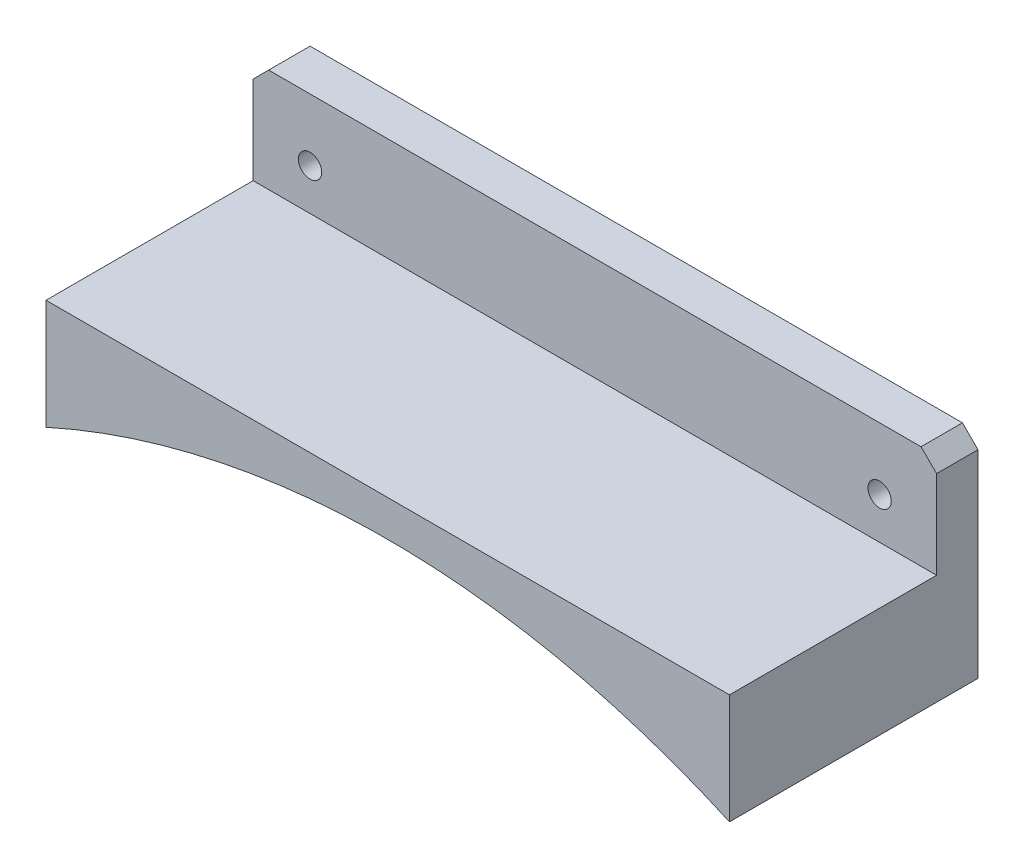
ISO-10303-21;
HEADER;
FILE_DESCRIPTION(('STEP AP214'),'2;1');
FILE_NAME('part.step','',(''),(''),'','','');
FILE_SCHEMA(('AUTOMOTIVE_DESIGN { 1 0 10303 214 1 1 1 1 }'));
ENDSEC;
DATA;
#1=APPLICATION_CONTEXT('core data for automotive mechanical design processes');
#2=APPLICATION_PROTOCOL_DEFINITION('international standard','automotive_design',2000,#1);
#3=PRODUCT_CONTEXT('',#1,'mechanical');
#4=PRODUCT('Part','Part','',(#3));
#5=PRODUCT_RELATED_PRODUCT_CATEGORY('part','',(#4));
#6=PRODUCT_DEFINITION_FORMATION('','',#4);
#7=PRODUCT_DEFINITION_CONTEXT('part definition',#1,'design');
#8=PRODUCT_DEFINITION('design','',#6,#7);
#9=PRODUCT_DEFINITION_SHAPE('','',#8);
#10=(LENGTH_UNIT() NAMED_UNIT(*) SI_UNIT(.MILLI.,.METRE.));
#11=(NAMED_UNIT(*) PLANE_ANGLE_UNIT() SI_UNIT($,.RADIAN.));
#12=(NAMED_UNIT(*) SI_UNIT($,.STERADIAN.) SOLID_ANGLE_UNIT());
#13=UNCERTAINTY_MEASURE_WITH_UNIT(LENGTH_MEASURE(1.E-05),#10,'distance_accuracy_value','');
#14=(GEOMETRIC_REPRESENTATION_CONTEXT(3) GLOBAL_UNCERTAINTY_ASSIGNED_CONTEXT((#13)) GLOBAL_UNIT_ASSIGNED_CONTEXT((#10,
#11,#12)) REPRESENTATION_CONTEXT('',''));
#15=CARTESIAN_POINT('',(0.,0.,0.));
#16=DIRECTION('',(0.,0.,1.));
#17=DIRECTION('',(1.,0.,0.));
#18=AXIS2_PLACEMENT_3D('',#15,#16,#17);
#19=CARTESIAN_POINT('',(0.,-167.,8.));
#20=DIRECTION('',(0.,0.,1.));
#21=DIRECTION('',(1.,0.,0.));
#22=AXIS2_PLACEMENT_3D('',#19,#20,#21);
#23=PLANE('',#22);
#24=DIRECTION('',(-1.,0.,0.));
#25=VECTOR('',#24,1.);
#26=CARTESIAN_POINT('',(-66.,0.,8.));
#27=LINE('',#26,#25);
#28=CARTESIAN_POINT('',(66.,0.,8.));
#29=VERTEX_POINT('',#28);
#30=CARTESIAN_POINT('',(-66.,0.,8.));
#31=VERTEX_POINT('',#30);
#32=EDGE_CURVE('E58',#29,#31,#27,.T.);
#33=ORIENTED_EDGE('',*,*,#32,.F.);
#34=DIRECTION('',(0.,1.,0.));
#35=VECTOR('',#34,1.);
#36=CARTESIAN_POINT('',(66.,17.,8.));
#37=LINE('',#36,#35);
#38=CARTESIAN_POINT('',(66.,17.,8.));
#39=VERTEX_POINT('',#38);
#40=EDGE_CURVE('E96',#29,#39,#37,.T.);
#41=ORIENTED_EDGE('',*,*,#40,.T.);
#42=DIRECTION('',(-0.707106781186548,0.707106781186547,0.));
#43=VECTOR('',#42,1.);
#44=CARTESIAN_POINT('',(63.,20.,8.));
#45=LINE('',#44,#43);
#46=CARTESIAN_POINT('',(63.,20.,8.));
#47=VERTEX_POINT('',#46);
#48=EDGE_CURVE('E158',#39,#47,#45,.T.);
#49=ORIENTED_EDGE('',*,*,#48,.T.);
#50=DIRECTION('',(-1.,0.,0.));
#51=VECTOR('',#50,1.);
#52=CARTESIAN_POINT('',(-63.,20.,8.));
#53=LINE('',#52,#51);
#54=CARTESIAN_POINT('',(-63.,20.,8.));
#55=VERTEX_POINT('',#54);
#56=EDGE_CURVE('E160',#47,#55,#53,.T.);
#57=ORIENTED_EDGE('',*,*,#56,.T.);
#58=DIRECTION('',(-0.707106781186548,-0.707106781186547,0.));
#59=VECTOR('',#58,1.);
#60=CARTESIAN_POINT('',(-66.,17.,8.));
#61=LINE('',#60,#59);
#62=CARTESIAN_POINT('',(-66.,17.,8.));
#63=VERTEX_POINT('',#62);
#64=EDGE_CURVE('E65',#55,#63,#61,.T.);
#65=ORIENTED_EDGE('',*,*,#64,.T.);
#66=DIRECTION('',(0.,-1.,0.));
#67=VECTOR('',#66,1.);
#68=CARTESIAN_POINT('',(-66.,-21.2467839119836,8.));
#69=LINE('',#68,#67);
#70=EDGE_CURVE('E155',#63,#31,#69,.T.);
#71=ORIENTED_EDGE('',*,*,#70,.T.);
#72=EDGE_LOOP('',(#33,#41,#49,#57,#65,#71));
#73=FACE_BOUND('',#72,.T.);
#74=CARTESIAN_POINT('',(-55.,8.,8.));
#75=DIRECTION('',(0.,0.,1.));
#76=DIRECTION('',(1.,0.,0.));
#77=AXIS2_PLACEMENT_3D('',#74,#75,#76);
#78=CIRCLE('',#77,2.25);
#79=CARTESIAN_POINT('',(-52.75,8.,8.));
#80=VERTEX_POINT('',#79);
#81=EDGE_CURVE('E150',#80,#80,#78,.T.);
#82=ORIENTED_EDGE('',*,*,#81,.F.);
#83=EDGE_LOOP('',(#82));
#84=FACE_BOUND('',#83,.T.);
#85=CARTESIAN_POINT('',(55.,8.,8.));
#86=DIRECTION('',(0.,0.,1.));
#87=DIRECTION('',(1.,0.,0.));
#88=AXIS2_PLACEMENT_3D('',#85,#86,#87);
#89=CIRCLE('',#88,2.25);
#90=CARTESIAN_POINT('',(57.25,8.,8.));
#91=VERTEX_POINT('',#90);
#92=EDGE_CURVE('E144',#91,#91,#89,.T.);
#93=ORIENTED_EDGE('',*,*,#92,.F.);
#94=EDGE_LOOP('',(#93));
#95=FACE_BOUND('',#94,.T.);
#96=ADVANCED_FACE('F43',(#73,#84,#95),#23,.T.);
#97=CARTESIAN_POINT('',(0.,-167.,0.));
#98=DIRECTION('',(0.,0.,1.));
#99=DIRECTION('',(1.,0.,0.));
#100=AXIS2_PLACEMENT_3D('',#97,#98,#99);
#101=PLANE('',#100);
#102=DIRECTION('',(0.,-1.,0.));
#103=VECTOR('',#102,1.);
#104=CARTESIAN_POINT('',(-66.,-21.2467839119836,0.));
#105=LINE('',#104,#103);
#106=CARTESIAN_POINT('',(-66.,17.,0.));
#107=VERTEX_POINT('',#106);
#108=CARTESIAN_POINT('',(-66.,-21.2467839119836,0.));
#109=VERTEX_POINT('',#108);
#110=EDGE_CURVE('E119',#107,#109,#105,.T.);
#111=ORIENTED_EDGE('',*,*,#110,.F.);
#112=DIRECTION('',(-0.707106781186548,-0.707106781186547,0.));
#113=VECTOR('',#112,1.);
#114=CARTESIAN_POINT('',(-66.,17.,0.));
#115=LINE('',#114,#113);
#116=CARTESIAN_POINT('',(-63.,20.,0.));
#117=VERTEX_POINT('',#116);
#118=EDGE_CURVE('E92',#117,#107,#115,.T.);
#119=ORIENTED_EDGE('',*,*,#118,.F.);
#120=DIRECTION('',(-1.,0.,0.));
#121=VECTOR('',#120,1.);
#122=CARTESIAN_POINT('',(-63.,20.,0.));
#123=LINE('',#122,#121);
#124=CARTESIAN_POINT('',(63.,20.,0.));
#125=VERTEX_POINT('',#124);
#126=EDGE_CURVE('E171',#125,#117,#123,.T.);
#127=ORIENTED_EDGE('',*,*,#126,.F.);
#128=DIRECTION('',(-0.707106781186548,0.707106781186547,0.));
#129=VECTOR('',#128,1.);
#130=CARTESIAN_POINT('',(63.,20.,0.));
#131=LINE('',#130,#129);
#132=CARTESIAN_POINT('',(66.,17.,0.));
#133=VERTEX_POINT('',#132);
#134=EDGE_CURVE('E169',#133,#125,#131,.T.);
#135=ORIENTED_EDGE('',*,*,#134,.F.);
#136=DIRECTION('',(0.,1.,0.));
#137=VECTOR('',#136,1.);
#138=CARTESIAN_POINT('',(66.,17.,0.));
#139=LINE('',#138,#137);
#140=CARTESIAN_POINT('',(66.,-21.2467839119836,0.));
#141=VERTEX_POINT('',#140);
#142=EDGE_CURVE('E167',#141,#133,#139,.T.);
#143=ORIENTED_EDGE('',*,*,#142,.F.);
#144=CARTESIAN_POINT('',(0.,-167.,0.));
#145=DIRECTION('',(0.,0.,-1.));
#146=DIRECTION('',(1.,0.,0.));
#147=AXIS2_PLACEMENT_3D('',#144,#145,#146);
#148=CIRCLE('',#147,160.);
#149=EDGE_CURVE('E165',#109,#141,#148,.T.);
#150=ORIENTED_EDGE('',*,*,#149,.F.);
#151=EDGE_LOOP('',(#111,#119,#127,#135,#143,#150));
#152=FACE_BOUND('',#151,.T.);
#153=CARTESIAN_POINT('',(-55.,8.,0.));
#154=DIRECTION('',(0.,0.,1.));
#155=DIRECTION('',(1.,0.,0.));
#156=AXIS2_PLACEMENT_3D('',#153,#154,#155);
#157=CIRCLE('',#156,2.25);
#158=CARTESIAN_POINT('',(-52.75,8.,0.));
#159=VERTEX_POINT('',#158);
#160=EDGE_CURVE('E147',#159,#159,#157,.T.);
#161=ORIENTED_EDGE('',*,*,#160,.T.);
#162=EDGE_LOOP('',(#161));
#163=FACE_BOUND('',#162,.T.);
#164=CARTESIAN_POINT('',(55.,8.,0.));
#165=DIRECTION('',(0.,0.,1.));
#166=DIRECTION('',(1.,0.,0.));
#167=AXIS2_PLACEMENT_3D('',#164,#165,#166);
#168=CIRCLE('',#167,2.25);
#169=CARTESIAN_POINT('',(57.25,8.,0.));
#170=VERTEX_POINT('',#169);
#171=EDGE_CURVE('E143',#170,#170,#168,.T.);
#172=ORIENTED_EDGE('',*,*,#171,.T.);
#173=EDGE_LOOP('',(#172));
#174=FACE_BOUND('',#173,.T.);
#175=ADVANCED_FACE('F188',(#152,#163,#174),#101,.F.);
#176=CARTESIAN_POINT('',(-66.,-21.2467839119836,8.));
#177=DIRECTION('',(1.,0.,0.));
#178=DIRECTION('',(0.,0.,-1.));
#179=AXIS2_PLACEMENT_3D('',#176,#177,#178);
#180=PLANE('',#179);
#181=ORIENTED_EDGE('',*,*,#110,.T.);
#182=DIRECTION('',(0.,0.,-1.));
#183=VECTOR('',#182,1.);
#184=CARTESIAN_POINT('',(-66.,-21.2467839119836,8.));
#185=LINE('',#184,#183);
#186=CARTESIAN_POINT('',(-66.,-21.2467839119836,48.));
#187=VERTEX_POINT('',#186);
#188=EDGE_CURVE('E11',#187,#109,#185,.T.);
#189=ORIENTED_EDGE('',*,*,#188,.F.);
#190=DIRECTION('',(0.,-1.,0.));
#191=VECTOR('',#190,1.);
#192=CARTESIAN_POINT('',(-66.,-21.2467839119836,48.));
#193=LINE('',#192,#191);
#194=CARTESIAN_POINT('',(-66.,0.,48.));
#195=VERTEX_POINT('',#194);
#196=EDGE_CURVE('E117',#195,#187,#193,.T.);
#197=ORIENTED_EDGE('',*,*,#196,.F.);
#198=DIRECTION('',(0.,0.,-1.));
#199=VECTOR('',#198,1.);
#200=CARTESIAN_POINT('',(-66.,0.,48.));
#201=LINE('',#200,#199);
#202=EDGE_CURVE('E137',#195,#31,#201,.T.);
#203=ORIENTED_EDGE('',*,*,#202,.T.);
#204=ORIENTED_EDGE('',*,*,#70,.F.);
#205=DIRECTION('',(0.,0.,-1.));
#206=VECTOR('',#205,1.);
#207=CARTESIAN_POINT('',(-66.,17.,8.));
#208=LINE('',#207,#206);
#209=EDGE_CURVE('E163',#63,#107,#208,.T.);
#210=ORIENTED_EDGE('',*,*,#209,.T.);
#211=EDGE_LOOP('',(#181,#189,#197,#203,#204,#210));
#212=FACE_BOUND('',#211,.T.);
#213=ADVANCED_FACE('F45',(#212),#180,.F.);
#214=CARTESIAN_POINT('',(0.,-167.,8.));
#215=DIRECTION('',(0.,0.,-1.));
#216=DIRECTION('',(-1.,0.,0.));
#217=AXIS2_PLACEMENT_3D('',#214,#215,#216);
#218=CYLINDRICAL_SURFACE('',#217,160.);
#219=ORIENTED_EDGE('',*,*,#149,.T.);
#220=DIRECTION('',(0.,0.,-1.));
#221=VECTOR('',#220,1.);
#222=CARTESIAN_POINT('',(66.,-21.2467839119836,8.));
#223=LINE('',#222,#221);
#224=CARTESIAN_POINT('',(66.,-21.2467839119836,48.));
#225=VERTEX_POINT('',#224);
#226=EDGE_CURVE('E51',#225,#141,#223,.T.);
#227=ORIENTED_EDGE('',*,*,#226,.F.);
#228=CARTESIAN_POINT('',(0.,-167.,48.));
#229=DIRECTION('',(0.,0.,-1.));
#230=DIRECTION('',(1.,0.,0.));
#231=AXIS2_PLACEMENT_3D('',#228,#229,#230);
#232=CIRCLE('',#231,160.);
#233=EDGE_CURVE('E122',#187,#225,#232,.T.);
#234=ORIENTED_EDGE('',*,*,#233,.F.);
#235=ORIENTED_EDGE('',*,*,#188,.T.);
#236=EDGE_LOOP('',(#219,#227,#234,#235));
#237=FACE_BOUND('',#236,.T.);
#238=ADVANCED_FACE('F123',(#237),#218,.F.);
#239=CARTESIAN_POINT('',(66.,17.,8.));
#240=DIRECTION('',(-1.,0.,0.));
#241=DIRECTION('',(0.,0.,1.));
#242=AXIS2_PLACEMENT_3D('',#239,#240,#241);
#243=PLANE('',#242);
#244=ORIENTED_EDGE('',*,*,#142,.T.);
#245=DIRECTION('',(0.,0.,-1.));
#246=VECTOR('',#245,1.);
#247=CARTESIAN_POINT('',(66.,17.,8.));
#248=LINE('',#247,#246);
#249=EDGE_CURVE('E180',#39,#133,#248,.T.);
#250=ORIENTED_EDGE('',*,*,#249,.F.);
#251=ORIENTED_EDGE('',*,*,#40,.F.);
#252=DIRECTION('',(0.,0.,-1.));
#253=VECTOR('',#252,1.);
#254=CARTESIAN_POINT('',(66.,0.,48.));
#255=LINE('',#254,#253);
#256=CARTESIAN_POINT('',(66.,0.,48.));
#257=VERTEX_POINT('',#256);
#258=EDGE_CURVE('E140',#257,#29,#255,.T.);
#259=ORIENTED_EDGE('',*,*,#258,.F.);
#260=DIRECTION('',(0.,1.,0.));
#261=VECTOR('',#260,1.);
#262=CARTESIAN_POINT('',(66.,0.,48.));
#263=LINE('',#262,#261);
#264=EDGE_CURVE('E127',#225,#257,#263,.T.);
#265=ORIENTED_EDGE('',*,*,#264,.F.);
#266=ORIENTED_EDGE('',*,*,#226,.T.);
#267=EDGE_LOOP('',(#244,#250,#251,#259,#265,#266));
#268=FACE_BOUND('',#267,.T.);
#269=ADVANCED_FACE('F184',(#268),#243,.F.);
#270=CARTESIAN_POINT('',(63.,20.,8.));
#271=DIRECTION('',(-0.707106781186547,-0.707106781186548,0.));
#272=DIRECTION('',(0.707106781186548,-0.707106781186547,0.));
#273=AXIS2_PLACEMENT_3D('',#270,#271,#272);
#274=PLANE('',#273);
#275=ORIENTED_EDGE('',*,*,#134,.T.);
#276=DIRECTION('',(0.,0.,-1.));
#277=VECTOR('',#276,1.);
#278=CARTESIAN_POINT('',(63.,20.,8.));
#279=LINE('',#278,#277);
#280=EDGE_CURVE('E177',#47,#125,#279,.T.);
#281=ORIENTED_EDGE('',*,*,#280,.F.);
#282=ORIENTED_EDGE('',*,*,#48,.F.);
#283=ORIENTED_EDGE('',*,*,#249,.T.);
#284=EDGE_LOOP('',(#275,#281,#282,#283));
#285=FACE_BOUND('',#284,.T.);
#286=ADVANCED_FACE('F193',(#285),#274,.F.);
#287=CARTESIAN_POINT('',(-63.,20.,8.));
#288=DIRECTION('',(0.,-1.,0.));
#289=DIRECTION('',(0.,0.,-1.));
#290=AXIS2_PLACEMENT_3D('',#287,#288,#289);
#291=PLANE('',#290);
#292=ORIENTED_EDGE('',*,*,#126,.T.);
#293=DIRECTION('',(0.,0.,-1.));
#294=VECTOR('',#293,1.);
#295=CARTESIAN_POINT('',(-63.,20.,8.));
#296=LINE('',#295,#294);
#297=EDGE_CURVE('E175',#55,#117,#296,.T.);
#298=ORIENTED_EDGE('',*,*,#297,.F.);
#299=ORIENTED_EDGE('',*,*,#56,.F.);
#300=ORIENTED_EDGE('',*,*,#280,.T.);
#301=EDGE_LOOP('',(#292,#298,#299,#300));
#302=FACE_BOUND('',#301,.T.);
#303=ADVANCED_FACE('F197',(#302),#291,.F.);
#304=CARTESIAN_POINT('',(-66.,17.,8.));
#305=DIRECTION('',(0.707106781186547,-0.707106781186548,0.));
#306=DIRECTION('',(0.707106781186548,0.707106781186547,0.));
#307=AXIS2_PLACEMENT_3D('',#304,#305,#306);
#308=PLANE('',#307);
#309=ORIENTED_EDGE('',*,*,#118,.T.);
#310=ORIENTED_EDGE('',*,*,#209,.F.);
#311=ORIENTED_EDGE('',*,*,#64,.F.);
#312=ORIENTED_EDGE('',*,*,#297,.T.);
#313=EDGE_LOOP('',(#309,#310,#311,#312));
#314=FACE_BOUND('',#313,.T.);
#315=ADVANCED_FACE('F222',(#314),#308,.F.);
#316=CARTESIAN_POINT('',(-55.,8.,8.));
#317=DIRECTION('',(0.,0.,-1.));
#318=DIRECTION('',(-1.,0.,0.));
#319=AXIS2_PLACEMENT_3D('',#316,#317,#318);
#320=CYLINDRICAL_SURFACE('',#319,2.25);
#321=ORIENTED_EDGE('',*,*,#81,.T.);
#322=EDGE_LOOP('',(#321));
#323=FACE_BOUND('',#322,.T.);
#324=ORIENTED_EDGE('',*,*,#160,.F.);
#325=EDGE_LOOP('',(#324));
#326=FACE_BOUND('',#325,.T.);
#327=ADVANCED_FACE('F210',(#323,#326),#320,.F.);
#328=CARTESIAN_POINT('',(55.,8.,8.));
#329=DIRECTION('',(0.,0.,-1.));
#330=DIRECTION('',(-1.,0.,0.));
#331=AXIS2_PLACEMENT_3D('',#328,#329,#330);
#332=CYLINDRICAL_SURFACE('',#331,2.25);
#333=ORIENTED_EDGE('',*,*,#92,.T.);
#334=EDGE_LOOP('',(#333));
#335=FACE_BOUND('',#334,.T.);
#336=ORIENTED_EDGE('',*,*,#171,.F.);
#337=EDGE_LOOP('',(#336));
#338=FACE_BOUND('',#337,.T.);
#339=ADVANCED_FACE('F206',(#335,#338),#332,.F.);
#340=CARTESIAN_POINT('',(-66.,0.,48.));
#341=DIRECTION('',(0.,-1.,0.));
#342=DIRECTION('',(0.,0.,-1.));
#343=AXIS2_PLACEMENT_3D('',#340,#341,#342);
#344=PLANE('',#343);
#345=ORIENTED_EDGE('',*,*,#32,.T.);
#346=ORIENTED_EDGE('',*,*,#202,.F.);
#347=DIRECTION('',(-1.,0.,0.));
#348=VECTOR('',#347,1.);
#349=CARTESIAN_POINT('',(-66.,0.,48.));
#350=LINE('',#349,#348);
#351=EDGE_CURVE('E131',#257,#195,#350,.T.);
#352=ORIENTED_EDGE('',*,*,#351,.F.);
#353=ORIENTED_EDGE('',*,*,#258,.T.);
#354=EDGE_LOOP('',(#345,#346,#352,#353));
#355=FACE_BOUND('',#354,.T.);
#356=ADVANCED_FACE('F209',(#355),#344,.F.);
#357=CARTESIAN_POINT('',(0.,-167.,48.));
#358=DIRECTION('',(0.,0.,1.));
#359=DIRECTION('',(1.,0.,0.));
#360=AXIS2_PLACEMENT_3D('',#357,#358,#359);
#361=PLANE('',#360);
#362=ORIENTED_EDGE('',*,*,#196,.T.);
#363=ORIENTED_EDGE('',*,*,#233,.T.);
#364=ORIENTED_EDGE('',*,*,#264,.T.);
#365=ORIENTED_EDGE('',*,*,#351,.T.);
#366=EDGE_LOOP('',(#362,#363,#364,#365));
#367=FACE_BOUND('',#366,.T.);
#368=ADVANCED_FACE('F129',(#367),#361,.T.);
#369=CLOSED_SHELL('',(#96,#175,#213,#238,#269,#286,#303,#315,#327,#339,#356,#368));
#370=MANIFOLD_SOLID_BREP('B2',#369);
#371=ADVANCED_BREP_SHAPE_REPRESENTATION('',(#18,#370),#14);
#372=SHAPE_DEFINITION_REPRESENTATION(#9,#371);
ENDSEC;
END-ISO-10303-21;
